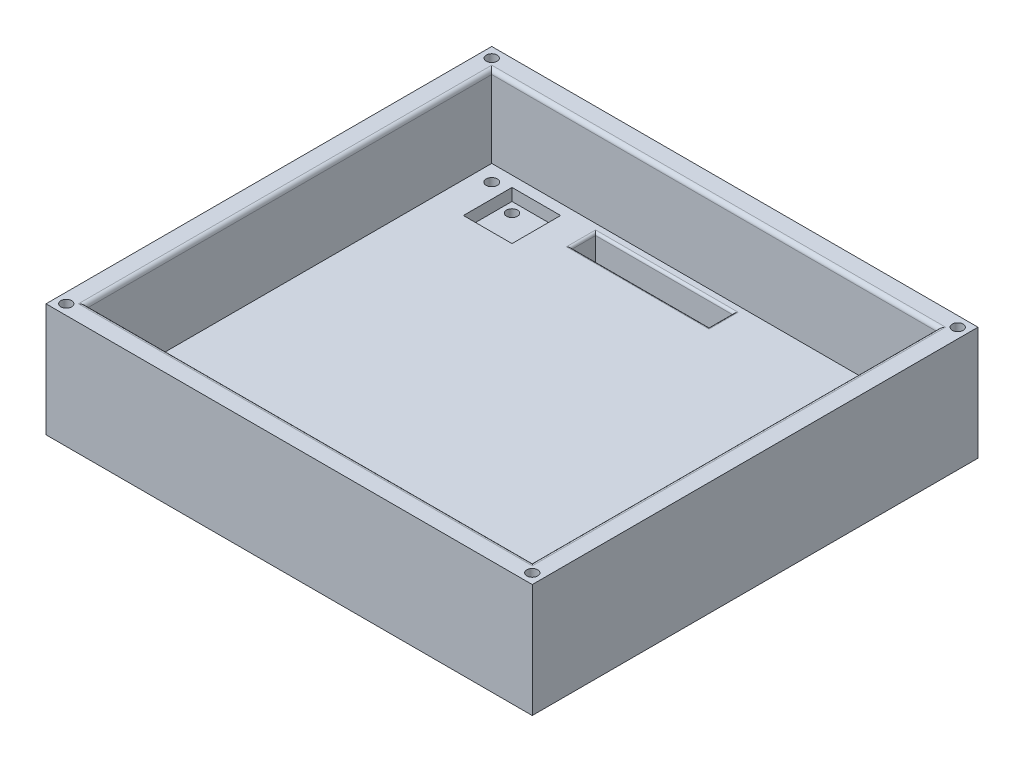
from build123d import *

# Parameters (mm, degrees)
SKETCH1_W             = 152.4
SKETCH1_H             = 139.7
SKETCH1_W_2           = 15.24
SKETCH1_H_2           = 15.24
BOSS_EXTRUDE1_DEPTH   = 10.16
BOSS_EXTRUDE2_START   = -10.16
SKETCH1_2_W           = 15.24
SKETCH1_2_H           = 15.24
BOSS_EXTRUDE2_DEPTH   = 6.35
BOSS_EXTRUDE2_2_DEPTH = 6.35
SKETCH3_W             = 152.4
SKETCH3_H             = 139.7
SKETCH3_W_2           = 139.7
SKETCH3_H_2           = 127
BOSS_EXTRUDE3_DEPTH   = 25.4
SKETCH4_R             = 1.7018
CUT_EXTRUDE1_DEPTH    = 17.78
SKETCH5_W             = 43.18
SKETCH5_H             = 7.62
CUT_EXTRUDE2_DEPTH    = 107.4453968
FILLET1_R             = 0.762
FILLET2_R             = 1.27
SKETCH6_R             = 1.7018
CUT_EXTRUDE3_DEPTH    = 3.81
SKETCH7_R             = 1.7653
CUT_EXTRUDE4_DEPTH    = 107.4453968


with BuildPart() as part:
    # Sketch1 → Boss-Extrude1 (new body)
    with BuildSketch(Plane(origin=(0, 0, 0), x_dir=(1, 0, 0), z_dir=(0, 1, 0))):
        Rectangle(SKETCH1_W, SKETCH1_H)
        with Locations((-52.5399, 52.5399)):
            Rectangle(SKETCH1_W_2, SKETCH1_H_2, mode=Mode.SUBTRACT)
        with Locations((51.2699, -51.2699)):
            Rectangle(SKETCH1_W_2, SKETCH1_H_2, mode=Mode.SUBTRACT)
    extrude(amount=-BOSS_EXTRUDE1_DEPTH)

    # Sketch3 → Boss-Extrude3 (add)
    with BuildSketch(Plane(origin=(0, 0, 0), x_dir=(1, 0, 0), z_dir=(0, 1, 0))):
        Rectangle(SKETCH3_W, SKETCH3_H)
        Rectangle(SKETCH3_W_2, SKETCH3_H_2, mode=Mode.SUBTRACT)
    extrude(amount=BOSS_EXTRUDE3_DEPTH)

    # Sketch4 → Cut-Extrude1 (cut)
    with BuildSketch(Plane(origin=(0, 25.4, 0), x_dir=(1, 0, 0), z_dir=(0, 1, 0))):
        with Locations(Location((-73.025, -66.675, 0), (0, 0, 270))):
            Circle(SKETCH4_R)
        with Locations(Location((73.025, -66.675, 0), (0, 0, 270))):
            Circle(SKETCH4_R)
        with Locations(Location((73.025, 66.675, 0), (0, 0, 270))):
            Circle(SKETCH4_R)
        with Locations(Location((-73.025, 66.675, 0), (0, 0, 270))):
            Circle(SKETCH4_R)
    extrude(amount=-CUT_EXTRUDE1_DEPTH, mode=Mode.SUBTRACT)

    # Sketch5 → Cut-Extrude2 (cut, through all)
    with BuildSketch(Plane(origin=(0, 0, 0), x_dir=(1, 0, 0), z_dir=(0, 1, 0))):
        with Locations((-13.1699, 57.15)):
            Rectangle(SKETCH5_W, SKETCH5_H)
    extrude(amount=-CUT_EXTRUDE2_DEPTH, mode=Mode.SUBTRACT)

    # Fillet1
    fillet1_edges = [part.edges().sort_by_distance(p)[0] for p in [
        (-34.7599, 0, -57.15),
        (-13.1699, 0, -53.34),
        (8.4201, 0, -57.15),
        (-13.1699, 0, -60.96),
    ]]
    fillet(fillet1_edges, radius=FILLET1_R)

    # Fillet2
    fillet2_edges = [part.edges().sort_by_distance(p)[0] for p in [
        (0, 25.4, 63.5),
        (-69.85, 25.4, 0),
        (0, 25.4, -63.5),
        (69.85, 25.4, 0),
    ]]
    fillet(fillet2_edges, radius=FILLET2_R)

    # Sketch7 → Cut-Extrude4 (cut, through all)
    with BuildSketch(Plane(origin=(0, 0, 0), x_dir=(1, 0, 0), z_dir=(0, 1, 0))):
        with Locations(Location((-64.77, 58.42, 0), (0, 0, 270))):
            Circle(SKETCH7_R)
        with Locations(Location((64.77, 58.42, 0), (0, 0, 270))):
            Circle(SKETCH7_R)
        with Locations(Location((64.77, -58.42, 0), (0, 0, 270))):
            Circle(SKETCH7_R)
        with Locations(Location((-64.77, -58.42, 0), (0, 0, 270))):
            Circle(SKETCH7_R)
    extrude(amount=-CUT_EXTRUDE4_DEPTH, mode=Mode.SUBTRACT)


with BuildPart() as body_2:
    # Sketch1_2 → Boss-Extrude2 (new body)
    with BuildSketch(Plane(origin=(0, 0, 0), x_dir=(1, 0, 0), z_dir=(0, 1, 0)).offset(BOSS_EXTRUDE2_START)):
        with Locations((-52.5399, 52.5399)):
            Rectangle(SKETCH1_2_W, SKETCH1_2_H)
    extrude(amount=BOSS_EXTRUDE2_DEPTH)


with BuildPart() as body_3:
    # Sketch1_2 → Boss-Extrude2 2 (new body)
    with BuildSketch(Plane(origin=(0, 0, 0), x_dir=(1, 0, 0), z_dir=(0, 1, 0)).offset(BOSS_EXTRUDE2_START)):
        with Locations((51.2699, -51.2699)):
            Rectangle(SKETCH1_2_W, SKETCH1_2_H)
    extrude(amount=BOSS_EXTRUDE2_2_DEPTH)


with BuildPart() as cut_extrude3_tool:
    # Sketch6 → Cut-Extrude3 (new body)
    with BuildSketch(Plane(origin=(0, -3.81, 0), x_dir=(1, 0, 0), z_dir=(0, 1, 0))):
        with Locations(Location((55.7149, -55.7149, 0), (0, 0, 270))):
            Circle(SKETCH6_R)
        with Locations(Location((-56.9849, 56.9849, 0), (0, 0, 270))):
            Circle(SKETCH6_R)
    extrude(amount=-CUT_EXTRUDE3_DEPTH)


with BuildPart() as body_2_1:
    add(body_2.part)

    # Cut-Extrude3: cut by cut_extrude3_tool
    add(cut_extrude3_tool.part, mode=Mode.SUBTRACT)


with BuildPart() as body_3_1:
    add(body_3.part)

    # Cut-Extrude3: cut by cut_extrude3_tool
    add(cut_extrude3_tool.part, mode=Mode.SUBTRACT)


solid = Compound([part.part, body_2_1.part, body_3_1.part])
